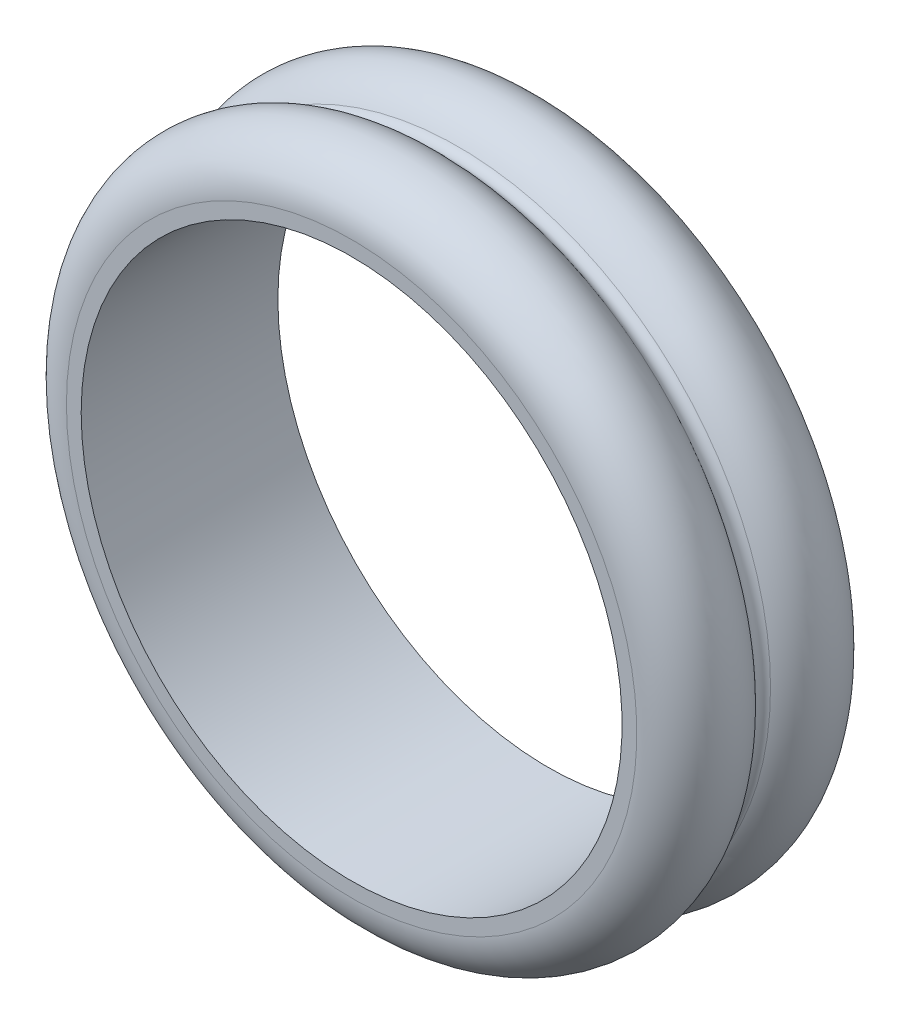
ISO-10303-21;
HEADER;
FILE_DESCRIPTION(('STEP AP214'),'2;1');
FILE_NAME('part.step','',(''),(''),'','','');
FILE_SCHEMA(('AUTOMOTIVE_DESIGN { 1 0 10303 214 1 1 1 1 }'));
ENDSEC;
DATA;
#1=APPLICATION_CONTEXT('core data for automotive mechanical design processes');
#2=APPLICATION_PROTOCOL_DEFINITION('international standard','automotive_design',2000,#1);
#3=PRODUCT_CONTEXT('',#1,'mechanical');
#4=PRODUCT('Part','Part','',(#3));
#5=PRODUCT_RELATED_PRODUCT_CATEGORY('part','',(#4));
#6=PRODUCT_DEFINITION_FORMATION('','',#4);
#7=PRODUCT_DEFINITION_CONTEXT('part definition',#1,'design');
#8=PRODUCT_DEFINITION('design','',#6,#7);
#9=PRODUCT_DEFINITION_SHAPE('','',#8);
#10=(LENGTH_UNIT() NAMED_UNIT(*) SI_UNIT(.MILLI.,.METRE.));
#11=(NAMED_UNIT(*) PLANE_ANGLE_UNIT() SI_UNIT($,.RADIAN.));
#12=(NAMED_UNIT(*) SI_UNIT($,.STERADIAN.) SOLID_ANGLE_UNIT());
#13=UNCERTAINTY_MEASURE_WITH_UNIT(LENGTH_MEASURE(1.E-05),#10,'distance_accuracy_value','');
#14=(GEOMETRIC_REPRESENTATION_CONTEXT(3) GLOBAL_UNCERTAINTY_ASSIGNED_CONTEXT((#13)) GLOBAL_UNIT_ASSIGNED_CONTEXT((#10,
#11,#12)) REPRESENTATION_CONTEXT('',''));
#15=CARTESIAN_POINT('',(0.,0.,0.));
#16=DIRECTION('',(0.,0.,1.));
#17=DIRECTION('',(1.,0.,0.));
#18=AXIS2_PLACEMENT_3D('',#15,#16,#17);
#19=CARTESIAN_POINT('',(25.,0.,-10.));
#20=DIRECTION('',(0.,0.,1.));
#21=DIRECTION('',(1.,0.,0.));
#22=AXIS2_PLACEMENT_3D('',#19,#20,#21);
#23=PLANE('',#22);
#24=CARTESIAN_POINT('',(0.,0.,-10.));
#25=DIRECTION('',(0.,0.,-1.));
#26=DIRECTION('',(-1.,0.,0.));
#27=AXIS2_PLACEMENT_3D('',#24,#25,#26);
#28=CIRCLE('',#27,27.5);
#29=CARTESIAN_POINT('',(-27.5,0.,-10.));
#30=VERTEX_POINT('',#29);
#31=EDGE_CURVE('E54',#30,#30,#28,.T.);
#32=ORIENTED_EDGE('',*,*,#31,.F.);
#33=EDGE_LOOP('',(#32));
#34=FACE_BOUND('',#33,.T.);
#35=CARTESIAN_POINT('',(0.,0.,-10.));
#36=DIRECTION('',(0.,0.,-1.));
#37=DIRECTION('',(-1.,0.,0.));
#38=AXIS2_PLACEMENT_3D('',#35,#36,#37);
#39=CIRCLE('',#38,29.);
#40=CARTESIAN_POINT('',(-29.,0.,-10.));
#41=VERTEX_POINT('',#40);
#42=EDGE_CURVE('E51',#41,#41,#39,.T.);
#43=ORIENTED_EDGE('',*,*,#42,.T.);
#44=EDGE_LOOP('',(#43));
#45=FACE_BOUND('',#44,.T.);
#46=ADVANCED_FACE('F35',(#34,#45),#23,.F.);
#47=CARTESIAN_POINT('',(25.,0.,10.));
#48=DIRECTION('',(0.,0.,-1.));
#49=DIRECTION('',(-1.,0.,0.));
#50=AXIS2_PLACEMENT_3D('',#47,#48,#49);
#51=PLANE('',#50);
#52=CARTESIAN_POINT('',(0.,0.,10.));
#53=DIRECTION('',(0.,0.,-1.));
#54=DIRECTION('',(-1.,0.,0.));
#55=AXIS2_PLACEMENT_3D('',#52,#53,#54);
#56=CIRCLE('',#55,27.5);
#57=CARTESIAN_POINT('',(-27.5,0.,10.));
#58=VERTEX_POINT('',#57);
#59=EDGE_CURVE('E38',#58,#58,#56,.T.);
#60=ORIENTED_EDGE('',*,*,#59,.T.);
#61=EDGE_LOOP('',(#60));
#62=FACE_BOUND('',#61,.T.);
#63=CARTESIAN_POINT('',(0.,0.,10.));
#64=DIRECTION('',(0.,0.,-1.));
#65=DIRECTION('',(-1.,0.,0.));
#66=AXIS2_PLACEMENT_3D('',#63,#64,#65);
#67=CIRCLE('',#66,29.);
#68=CARTESIAN_POINT('',(-29.,0.,10.));
#69=VERTEX_POINT('',#68);
#70=EDGE_CURVE('E10',#69,#69,#67,.T.);
#71=ORIENTED_EDGE('',*,*,#70,.F.);
#72=EDGE_LOOP('',(#71));
#73=FACE_BOUND('',#72,.T.);
#74=ADVANCED_FACE('F61',(#62,#73),#51,.F.);
#75=CARTESIAN_POINT('',(0.,0.,5.));
#76=DIRECTION('',(0.,0.,-1.));
#77=DIRECTION('',(-1.,0.,0.));
#78=AXIS2_PLACEMENT_3D('',#75,#76,#77);
#79=TOROIDAL_SURFACE('',#78,29.,5.);
#80=CARTESIAN_POINT('',(0.,0.,0.833333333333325));
#81=DIRECTION('',(0.,0.,-1.));
#82=DIRECTION('',(-1.,0.,0.));
#83=AXIS2_PLACEMENT_3D('',#80,#81,#82);
#84=CIRCLE('',#83,31.7638539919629);
#85=CARTESIAN_POINT('',(-31.7638539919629,0.,0.833333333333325));
#86=VERTEX_POINT('',#85);
#87=EDGE_CURVE('E42',#86,#86,#84,.T.);
#88=ORIENTED_EDGE('',*,*,#87,.F.);
#89=EDGE_LOOP('',(#88));
#90=FACE_BOUND('',#89,.T.);
#91=ORIENTED_EDGE('',*,*,#70,.T.);
#92=EDGE_LOOP('',(#91));
#93=FACE_BOUND('',#92,.T.);
#94=ADVANCED_FACE('F80',(#90,#93),#79,.T.);
#95=CARTESIAN_POINT('',(0.,0.,0.));
#96=DIRECTION('',(0.,0.,-1.));
#97=DIRECTION('',(-1.,0.,0.));
#98=AXIS2_PLACEMENT_3D('',#95,#96,#97);
#99=TOROIDAL_SURFACE('',#98,32.3166247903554,1.);
#100=CARTESIAN_POINT('',(0.,0.,-0.833333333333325));
#101=DIRECTION('',(0.,0.,-1.));
#102=DIRECTION('',(-1.,0.,0.));
#103=AXIS2_PLACEMENT_3D('',#100,#101,#102);
#104=CIRCLE('',#103,31.7638539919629);
#105=CARTESIAN_POINT('',(-31.7638539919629,0.,-0.833333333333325));
#106=VERTEX_POINT('',#105);
#107=EDGE_CURVE('E46',#106,#106,#104,.T.);
#108=ORIENTED_EDGE('',*,*,#107,.F.);
#109=EDGE_LOOP('',(#108));
#110=FACE_BOUND('',#109,.T.);
#111=ORIENTED_EDGE('',*,*,#87,.T.);
#112=EDGE_LOOP('',(#111));
#113=FACE_BOUND('',#112,.T.);
#114=ADVANCED_FACE('F71',(#110,#113),#99,.F.);
#115=CARTESIAN_POINT('',(0.,0.,-5.));
#116=DIRECTION('',(0.,0.,-1.));
#117=DIRECTION('',(-1.,0.,0.));
#118=AXIS2_PLACEMENT_3D('',#115,#116,#117);
#119=TOROIDAL_SURFACE('',#118,29.,5.);
#120=ORIENTED_EDGE('',*,*,#42,.F.);
#121=EDGE_LOOP('',(#120));
#122=FACE_BOUND('',#121,.T.);
#123=ORIENTED_EDGE('',*,*,#107,.T.);
#124=EDGE_LOOP('',(#123));
#125=FACE_BOUND('',#124,.T.);
#126=ADVANCED_FACE('F66',(#122,#125),#119,.T.);
#127=CARTESIAN_POINT('',(0.,0.,45.));
#128=DIRECTION('',(0.,0.,-1.));
#129=DIRECTION('',(-1.,0.,0.));
#130=AXIS2_PLACEMENT_3D('',#127,#128,#129);
#131=CYLINDRICAL_SURFACE('',#130,27.5);
#132=ORIENTED_EDGE('',*,*,#31,.T.);
#133=EDGE_LOOP('',(#132));
#134=FACE_BOUND('',#133,.T.);
#135=ORIENTED_EDGE('',*,*,#59,.F.);
#136=EDGE_LOOP('',(#135));
#137=FACE_BOUND('',#136,.T.);
#138=ADVANCED_FACE('F64',(#134,#137),#131,.F.);
#139=CLOSED_SHELL('',(#46,#74,#94,#114,#126,#138));
#140=MANIFOLD_SOLID_BREP('B2',#139);
#141=ADVANCED_BREP_SHAPE_REPRESENTATION('',(#18,#140),#14);
#142=SHAPE_DEFINITION_REPRESENTATION(#9,#141);
ENDSEC;
END-ISO-10303-21;
